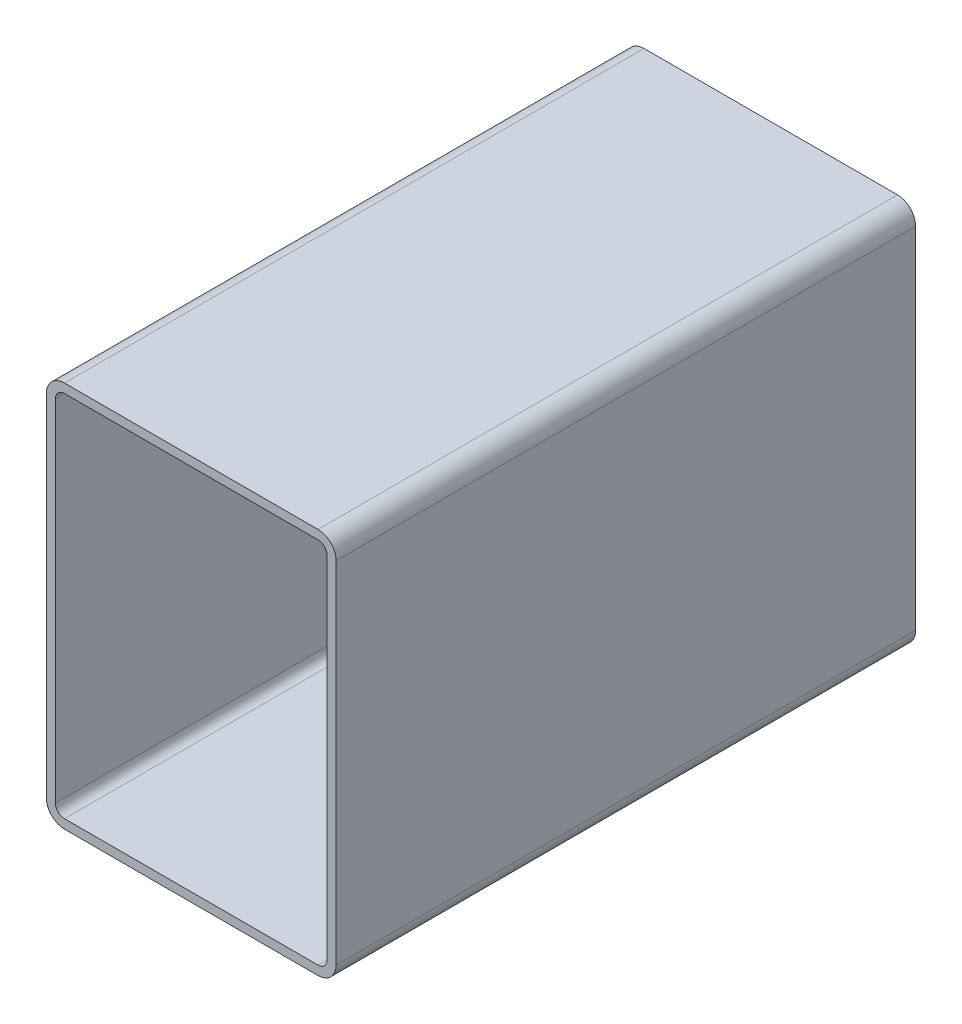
ISO-10303-21;
HEADER;
FILE_DESCRIPTION(('STEP AP214'),'2;1');
FILE_NAME('part.step','',(''),(''),'','','');
FILE_SCHEMA(('AUTOMOTIVE_DESIGN { 1 0 10303 214 1 1 1 1 }'));
ENDSEC;
DATA;
#1=APPLICATION_CONTEXT('core data for automotive mechanical design processes');
#2=APPLICATION_PROTOCOL_DEFINITION('international standard','automotive_design',2000,#1);
#3=PRODUCT_CONTEXT('',#1,'mechanical');
#4=PRODUCT('Part','Part','',(#3));
#5=PRODUCT_RELATED_PRODUCT_CATEGORY('part','',(#4));
#6=PRODUCT_DEFINITION_FORMATION('','',#4);
#7=PRODUCT_DEFINITION_CONTEXT('part definition',#1,'design');
#8=PRODUCT_DEFINITION('design','',#6,#7);
#9=PRODUCT_DEFINITION_SHAPE('','',#8);
#10=(LENGTH_UNIT() NAMED_UNIT(*) SI_UNIT(.MILLI.,.METRE.));
#11=(NAMED_UNIT(*) PLANE_ANGLE_UNIT() SI_UNIT($,.RADIAN.));
#12=(NAMED_UNIT(*) SI_UNIT($,.STERADIAN.) SOLID_ANGLE_UNIT());
#13=UNCERTAINTY_MEASURE_WITH_UNIT(LENGTH_MEASURE(1.E-05),#10,'distance_accuracy_value','');
#14=(GEOMETRIC_REPRESENTATION_CONTEXT(3) GLOBAL_UNCERTAINTY_ASSIGNED_CONTEXT((#13)) GLOBAL_UNIT_ASSIGNED_CONTEXT((#10,
#11,#12)) REPRESENTATION_CONTEXT('',''));
#15=CARTESIAN_POINT('',(0.,0.,0.));
#16=DIRECTION('',(0.,0.,1.));
#17=DIRECTION('',(1.,0.,0.));
#18=AXIS2_PLACEMENT_3D('',#15,#16,#17);
#19=CARTESIAN_POINT('',(9.57230139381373,195.641130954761,304.8));
#20=DIRECTION('',(0.,0.,1.));
#21=DIRECTION('',(1.,0.,0.));
#22=AXIS2_PLACEMENT_3D('',#19,#20,#21);
#23=PLANE('',#22);
#24=CARTESIAN_POINT('',(9.57230139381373,195.641130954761,304.8));
#25=DIRECTION('',(0.,0.,1.));
#26=DIRECTION('',(1.,0.,0.));
#27=AXIS2_PLACEMENT_3D('',#24,#25,#26);
#28=CIRCLE('',#27,9.52500000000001);
#29=CARTESIAN_POINT('',(9.57230139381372,205.166130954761,304.8));
#30=VERTEX_POINT('',#29);
#31=CARTESIAN_POINT('',(0.0473013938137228,195.641130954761,304.8));
#32=VERTEX_POINT('',#31);
#33=EDGE_CURVE('E211',#30,#32,#28,.T.);
#34=ORIENTED_EDGE('',*,*,#33,.T.);
#35=DIRECTION('',(0.,-1.,0.));
#36=VECTOR('',#35,1.);
#37=CARTESIAN_POINT('',(0.0473013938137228,11.4911309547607,304.8));
#38=LINE('',#37,#36);
#39=CARTESIAN_POINT('',(0.0473013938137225,11.4911309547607,304.8));
#40=VERTEX_POINT('',#39);
#41=EDGE_CURVE('E214',#32,#40,#38,.T.);
#42=ORIENTED_EDGE('',*,*,#41,.T.);
#43=CARTESIAN_POINT('',(9.57230139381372,11.4911309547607,304.8));
#44=DIRECTION('',(0.,0.,1.));
#45=DIRECTION('',(1.,0.,0.));
#46=AXIS2_PLACEMENT_3D('',#43,#44,#45);
#47=CIRCLE('',#46,9.525);
#48=CARTESIAN_POINT('',(9.57230139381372,1.96613095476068,304.8));
#49=VERTEX_POINT('',#48);
#50=EDGE_CURVE('E217',#40,#49,#47,.T.);
#51=ORIENTED_EDGE('',*,*,#50,.T.);
#52=DIRECTION('',(1.,0.,0.));
#53=VECTOR('',#52,1.);
#54=CARTESIAN_POINT('',(142.922301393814,1.96613095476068,304.8));
#55=LINE('',#54,#53);
#56=CARTESIAN_POINT('',(142.922301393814,1.96613095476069,304.8));
#57=VERTEX_POINT('',#56);
#58=EDGE_CURVE('E219',#49,#57,#55,.T.);
#59=ORIENTED_EDGE('',*,*,#58,.T.);
#60=CARTESIAN_POINT('',(142.922301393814,11.4911309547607,304.8));
#61=DIRECTION('',(0.,0.,1.));
#62=DIRECTION('',(1.,0.,0.));
#63=AXIS2_PLACEMENT_3D('',#60,#61,#62);
#64=CIRCLE('',#63,9.52500000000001);
#65=CARTESIAN_POINT('',(152.447301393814,11.4911309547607,304.8));
#66=VERTEX_POINT('',#65);
#67=EDGE_CURVE('E221',#57,#66,#64,.T.);
#68=ORIENTED_EDGE('',*,*,#67,.T.);
#69=DIRECTION('',(0.,1.,0.));
#70=VECTOR('',#69,1.);
#71=CARTESIAN_POINT('',(152.447301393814,195.641130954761,304.8));
#72=LINE('',#71,#70);
#73=CARTESIAN_POINT('',(152.447301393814,195.641130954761,304.8));
#74=VERTEX_POINT('',#73);
#75=EDGE_CURVE('E223',#66,#74,#72,.T.);
#76=ORIENTED_EDGE('',*,*,#75,.T.);
#77=CARTESIAN_POINT('',(142.922301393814,195.641130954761,304.8));
#78=DIRECTION('',(0.,0.,1.));
#79=DIRECTION('',(1.,0.,0.));
#80=AXIS2_PLACEMENT_3D('',#77,#78,#79);
#81=CIRCLE('',#80,9.52500000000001);
#82=CARTESIAN_POINT('',(142.922301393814,205.166130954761,304.8));
#83=VERTEX_POINT('',#82);
#84=EDGE_CURVE('E225',#74,#83,#81,.T.);
#85=ORIENTED_EDGE('',*,*,#84,.T.);
#86=DIRECTION('',(-1.,0.,0.));
#87=VECTOR('',#86,1.);
#88=CARTESIAN_POINT('',(9.57230139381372,205.166130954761,304.8));
#89=LINE('',#88,#87);
#90=EDGE_CURVE('E227',#83,#30,#89,.T.);
#91=ORIENTED_EDGE('',*,*,#90,.T.);
#92=EDGE_LOOP('',(#34,#42,#51,#59,#68,#76,#85,#91));
#93=FACE_BOUND('',#92,.T.);
#94=DIRECTION('',(0.,-1.,0.));
#95=VECTOR('',#94,1.);
#96=CARTESIAN_POINT('',(4.80980139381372,11.4911309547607,304.8));
#97=LINE('',#96,#95);
#98=CARTESIAN_POINT('',(4.80980139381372,195.641130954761,304.8));
#99=VERTEX_POINT('',#98);
#100=CARTESIAN_POINT('',(4.80980139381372,11.4911309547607,304.8));
#101=VERTEX_POINT('',#100);
#102=EDGE_CURVE('E154',#99,#101,#97,.T.);
#103=ORIENTED_EDGE('',*,*,#102,.F.);
#104=CARTESIAN_POINT('',(9.57230139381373,195.641130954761,304.8));
#105=DIRECTION('',(0.,0.,1.));
#106=DIRECTION('',(1.,0.,0.));
#107=AXIS2_PLACEMENT_3D('',#104,#105,#106);
#108=CIRCLE('',#107,4.7625);
#109=CARTESIAN_POINT('',(9.57230139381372,200.403630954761,304.8));
#110=VERTEX_POINT('',#109);
#111=EDGE_CURVE('E146',#110,#99,#108,.T.);
#112=ORIENTED_EDGE('',*,*,#111,.F.);
#113=DIRECTION('',(-1.,0.,0.));
#114=VECTOR('',#113,1.);
#115=CARTESIAN_POINT('',(9.57230139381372,200.403630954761,304.8));
#116=LINE('',#115,#114);
#117=CARTESIAN_POINT('',(142.922301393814,200.403630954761,304.8));
#118=VERTEX_POINT('',#117);
#119=EDGE_CURVE('E179',#118,#110,#116,.T.);
#120=ORIENTED_EDGE('',*,*,#119,.F.);
#121=CARTESIAN_POINT('',(142.922301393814,195.641130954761,304.8));
#122=DIRECTION('',(0.,0.,1.));
#123=DIRECTION('',(1.,0.,0.));
#124=AXIS2_PLACEMENT_3D('',#121,#122,#123);
#125=CIRCLE('',#124,4.7625);
#126=CARTESIAN_POINT('',(147.684801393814,195.641130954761,304.8));
#127=VERTEX_POINT('',#126);
#128=EDGE_CURVE('E177',#127,#118,#125,.T.);
#129=ORIENTED_EDGE('',*,*,#128,.F.);
#130=DIRECTION('',(0.,1.,0.));
#131=VECTOR('',#130,1.);
#132=CARTESIAN_POINT('',(147.684801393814,195.641130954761,304.8));
#133=LINE('',#132,#131);
#134=CARTESIAN_POINT('',(147.684801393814,11.4911309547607,304.8));
#135=VERTEX_POINT('',#134);
#136=EDGE_CURVE('E175',#135,#127,#133,.T.);
#137=ORIENTED_EDGE('',*,*,#136,.F.);
#138=CARTESIAN_POINT('',(142.922301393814,11.4911309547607,304.8));
#139=DIRECTION('',(0.,0.,1.));
#140=DIRECTION('',(1.,0.,0.));
#141=AXIS2_PLACEMENT_3D('',#138,#139,#140);
#142=CIRCLE('',#141,4.7625);
#143=CARTESIAN_POINT('',(142.922301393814,6.72863095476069,304.8));
#144=VERTEX_POINT('',#143);
#145=EDGE_CURVE('E173',#144,#135,#142,.T.);
#146=ORIENTED_EDGE('',*,*,#145,.F.);
#147=DIRECTION('',(1.,0.,0.));
#148=VECTOR('',#147,1.);
#149=CARTESIAN_POINT('',(142.922301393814,6.72863095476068,304.8));
#150=LINE('',#149,#148);
#151=CARTESIAN_POINT('',(9.57230139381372,6.72863095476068,304.8));
#152=VERTEX_POINT('',#151);
#153=EDGE_CURVE('E169',#152,#144,#150,.T.);
#154=ORIENTED_EDGE('',*,*,#153,.F.);
#155=CARTESIAN_POINT('',(9.57230139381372,11.4911309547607,304.8));
#156=DIRECTION('',(0.,0.,1.));
#157=DIRECTION('',(1.,0.,0.));
#158=AXIS2_PLACEMENT_3D('',#155,#156,#157);
#159=CIRCLE('',#158,4.7625);
#160=EDGE_CURVE('E167',#101,#152,#159,.T.);
#161=ORIENTED_EDGE('',*,*,#160,.F.);
#162=EDGE_LOOP('',(#103,#112,#120,#129,#137,#146,#154,#161));
#163=FACE_BOUND('',#162,.T.);
#164=ADVANCED_FACE('F33',(#93,#163),#23,.T.);
#165=CARTESIAN_POINT('',(9.57230139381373,195.641130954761,0.));
#166=DIRECTION('',(0.,0.,1.));
#167=DIRECTION('',(1.,0.,0.));
#168=AXIS2_PLACEMENT_3D('',#165,#166,#167);
#169=PLANE('',#168);
#170=CARTESIAN_POINT('',(9.57230139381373,195.641130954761,0.));
#171=DIRECTION('',(0.,0.,1.));
#172=DIRECTION('',(1.,0.,0.));
#173=AXIS2_PLACEMENT_3D('',#170,#171,#172);
#174=CIRCLE('',#173,9.52500000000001);
#175=CARTESIAN_POINT('',(9.57230139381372,205.166130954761,0.));
#176=VERTEX_POINT('',#175);
#177=CARTESIAN_POINT('',(0.0473013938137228,195.641130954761,0.));
#178=VERTEX_POINT('',#177);
#179=EDGE_CURVE('E162',#176,#178,#174,.T.);
#180=ORIENTED_EDGE('',*,*,#179,.F.);
#181=DIRECTION('',(-1.,0.,0.));
#182=VECTOR('',#181,1.);
#183=CARTESIAN_POINT('',(9.57230139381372,205.166130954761,0.));
#184=LINE('',#183,#182);
#185=CARTESIAN_POINT('',(142.922301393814,205.166130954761,0.));
#186=VERTEX_POINT('',#185);
#187=EDGE_CURVE('E215',#186,#176,#184,.T.);
#188=ORIENTED_EDGE('',*,*,#187,.F.);
#189=CARTESIAN_POINT('',(142.922301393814,195.641130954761,0.));
#190=DIRECTION('',(0.,0.,1.));
#191=DIRECTION('',(1.,0.,0.));
#192=AXIS2_PLACEMENT_3D('',#189,#190,#191);
#193=CIRCLE('',#192,9.52500000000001);
#194=CARTESIAN_POINT('',(152.447301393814,195.641130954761,0.));
#195=VERTEX_POINT('',#194);
#196=EDGE_CURVE('E242',#195,#186,#193,.T.);
#197=ORIENTED_EDGE('',*,*,#196,.F.);
#198=DIRECTION('',(0.,1.,0.));
#199=VECTOR('',#198,1.);
#200=CARTESIAN_POINT('',(152.447301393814,195.641130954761,0.));
#201=LINE('',#200,#199);
#202=CARTESIAN_POINT('',(152.447301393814,11.4911309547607,0.));
#203=VERTEX_POINT('',#202);
#204=EDGE_CURVE('E240',#203,#195,#201,.T.);
#205=ORIENTED_EDGE('',*,*,#204,.F.);
#206=CARTESIAN_POINT('',(142.922301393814,11.4911309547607,0.));
#207=DIRECTION('',(0.,0.,1.));
#208=DIRECTION('',(1.,0.,0.));
#209=AXIS2_PLACEMENT_3D('',#206,#207,#208);
#210=CIRCLE('',#209,9.52500000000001);
#211=CARTESIAN_POINT('',(142.922301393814,1.96613095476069,0.));
#212=VERTEX_POINT('',#211);
#213=EDGE_CURVE('E238',#212,#203,#210,.T.);
#214=ORIENTED_EDGE('',*,*,#213,.F.);
#215=DIRECTION('',(1.,0.,0.));
#216=VECTOR('',#215,1.);
#217=CARTESIAN_POINT('',(142.922301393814,1.96613095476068,0.));
#218=LINE('',#217,#216);
#219=CARTESIAN_POINT('',(9.57230139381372,1.96613095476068,0.));
#220=VERTEX_POINT('',#219);
#221=EDGE_CURVE('E236',#220,#212,#218,.T.);
#222=ORIENTED_EDGE('',*,*,#221,.F.);
#223=CARTESIAN_POINT('',(9.57230139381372,11.4911309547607,0.));
#224=DIRECTION('',(0.,0.,1.));
#225=DIRECTION('',(1.,0.,0.));
#226=AXIS2_PLACEMENT_3D('',#223,#224,#225);
#227=CIRCLE('',#226,9.525);
#228=CARTESIAN_POINT('',(0.0473013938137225,11.4911309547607,0.));
#229=VERTEX_POINT('',#228);
#230=EDGE_CURVE('E234',#229,#220,#227,.T.);
#231=ORIENTED_EDGE('',*,*,#230,.F.);
#232=DIRECTION('',(0.,-1.,0.));
#233=VECTOR('',#232,1.);
#234=CARTESIAN_POINT('',(0.0473013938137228,11.4911309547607,0.));
#235=LINE('',#234,#233);
#236=EDGE_CURVE('E232',#178,#229,#235,.T.);
#237=ORIENTED_EDGE('',*,*,#236,.F.);
#238=EDGE_LOOP('',(#180,#188,#197,#205,#214,#222,#231,#237));
#239=FACE_BOUND('',#238,.T.);
#240=CARTESIAN_POINT('',(9.57230139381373,195.641130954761,0.));
#241=DIRECTION('',(0.,0.,1.));
#242=DIRECTION('',(1.,0.,0.));
#243=AXIS2_PLACEMENT_3D('',#240,#241,#242);
#244=CIRCLE('',#243,4.7625);
#245=CARTESIAN_POINT('',(9.57230139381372,200.403630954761,0.));
#246=VERTEX_POINT('',#245);
#247=CARTESIAN_POINT('',(4.80980139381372,195.641130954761,0.));
#248=VERTEX_POINT('',#247);
#249=EDGE_CURVE('E56',#246,#248,#244,.T.);
#250=ORIENTED_EDGE('',*,*,#249,.T.);
#251=DIRECTION('',(0.,-1.,0.));
#252=VECTOR('',#251,1.);
#253=CARTESIAN_POINT('',(4.80980139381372,11.4911309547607,0.));
#254=LINE('',#253,#252);
#255=CARTESIAN_POINT('',(4.80980139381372,11.4911309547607,0.));
#256=VERTEX_POINT('',#255);
#257=EDGE_CURVE('E161',#248,#256,#254,.T.);
#258=ORIENTED_EDGE('',*,*,#257,.T.);
#259=CARTESIAN_POINT('',(9.57230139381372,11.4911309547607,0.));
#260=DIRECTION('',(0.,0.,1.));
#261=DIRECTION('',(1.,0.,0.));
#262=AXIS2_PLACEMENT_3D('',#259,#260,#261);
#263=CIRCLE('',#262,4.7625);
#264=CARTESIAN_POINT('',(9.57230139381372,6.72863095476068,0.));
#265=VERTEX_POINT('',#264);
#266=EDGE_CURVE('E183',#256,#265,#263,.T.);
#267=ORIENTED_EDGE('',*,*,#266,.T.);
#268=DIRECTION('',(1.,0.,0.));
#269=VECTOR('',#268,1.);
#270=CARTESIAN_POINT('',(142.922301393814,6.72863095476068,0.));
#271=LINE('',#270,#269);
#272=CARTESIAN_POINT('',(142.922301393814,6.72863095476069,0.));
#273=VERTEX_POINT('',#272);
#274=EDGE_CURVE('E186',#265,#273,#271,.T.);
#275=ORIENTED_EDGE('',*,*,#274,.T.);
#276=CARTESIAN_POINT('',(142.922301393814,11.4911309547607,0.));
#277=DIRECTION('',(0.,0.,1.));
#278=DIRECTION('',(1.,0.,0.));
#279=AXIS2_PLACEMENT_3D('',#276,#277,#278);
#280=CIRCLE('',#279,4.7625);
#281=CARTESIAN_POINT('',(147.684801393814,11.4911309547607,0.));
#282=VERTEX_POINT('',#281);
#283=EDGE_CURVE('E189',#273,#282,#280,.T.);
#284=ORIENTED_EDGE('',*,*,#283,.T.);
#285=DIRECTION('',(0.,1.,0.));
#286=VECTOR('',#285,1.);
#287=CARTESIAN_POINT('',(147.684801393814,195.641130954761,0.));
#288=LINE('',#287,#286);
#289=CARTESIAN_POINT('',(147.684801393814,195.641130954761,0.));
#290=VERTEX_POINT('',#289);
#291=EDGE_CURVE('E192',#282,#290,#288,.T.);
#292=ORIENTED_EDGE('',*,*,#291,.T.);
#293=CARTESIAN_POINT('',(142.922301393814,195.641130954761,0.));
#294=DIRECTION('',(0.,0.,1.));
#295=DIRECTION('',(1.,0.,0.));
#296=AXIS2_PLACEMENT_3D('',#293,#294,#295);
#297=CIRCLE('',#296,4.7625);
#298=CARTESIAN_POINT('',(142.922301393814,200.403630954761,0.));
#299=VERTEX_POINT('',#298);
#300=EDGE_CURVE('E195',#290,#299,#297,.T.);
#301=ORIENTED_EDGE('',*,*,#300,.T.);
#302=DIRECTION('',(-1.,0.,0.));
#303=VECTOR('',#302,1.);
#304=CARTESIAN_POINT('',(9.57230139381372,200.403630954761,0.));
#305=LINE('',#304,#303);
#306=EDGE_CURVE('E155',#299,#246,#305,.T.);
#307=ORIENTED_EDGE('',*,*,#306,.T.);
#308=EDGE_LOOP('',(#250,#258,#267,#275,#284,#292,#301,#307));
#309=FACE_BOUND('',#308,.T.);
#310=ADVANCED_FACE('F272',(#239,#309),#169,.F.);
#311=CARTESIAN_POINT('',(9.57230139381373,195.641130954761,304.8));
#312=DIRECTION('',(0.,0.,-1.));
#313=DIRECTION('',(-1.,0.,0.));
#314=AXIS2_PLACEMENT_3D('',#311,#312,#313);
#315=CYLINDRICAL_SURFACE('',#314,9.52500000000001);
#316=ORIENTED_EDGE('',*,*,#179,.T.);
#317=DIRECTION('',(0.,0.,-1.));
#318=VECTOR('',#317,1.);
#319=CARTESIAN_POINT('',(0.0473013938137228,195.641130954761,304.8));
#320=LINE('',#319,#318);
#321=EDGE_CURVE('E11',#32,#178,#320,.T.);
#322=ORIENTED_EDGE('',*,*,#321,.F.);
#323=ORIENTED_EDGE('',*,*,#33,.F.);
#324=DIRECTION('',(0.,0.,-1.));
#325=VECTOR('',#324,1.);
#326=CARTESIAN_POINT('',(9.57230139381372,205.166130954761,304.8));
#327=LINE('',#326,#325);
#328=EDGE_CURVE('E229',#30,#176,#327,.T.);
#329=ORIENTED_EDGE('',*,*,#328,.T.);
#330=EDGE_LOOP('',(#316,#322,#323,#329));
#331=FACE_BOUND('',#330,.T.);
#332=ADVANCED_FACE('F35',(#331),#315,.T.);
#333=CARTESIAN_POINT('',(0.0473013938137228,11.4911309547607,304.8));
#334=DIRECTION('',(1.,0.,0.));
#335=DIRECTION('',(0.,0.,-1.));
#336=AXIS2_PLACEMENT_3D('',#333,#334,#335);
#337=PLANE('',#336);
#338=ORIENTED_EDGE('',*,*,#236,.T.);
#339=DIRECTION('',(0.,0.,-1.));
#340=VECTOR('',#339,1.);
#341=CARTESIAN_POINT('',(0.0473013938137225,11.4911309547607,304.8));
#342=LINE('',#341,#340);
#343=EDGE_CURVE('E41',#40,#229,#342,.T.);
#344=ORIENTED_EDGE('',*,*,#343,.F.);
#345=ORIENTED_EDGE('',*,*,#41,.F.);
#346=ORIENTED_EDGE('',*,*,#321,.T.);
#347=EDGE_LOOP('',(#338,#344,#345,#346));
#348=FACE_BOUND('',#347,.T.);
#349=ADVANCED_FACE('F289',(#348),#337,.F.);
#350=CARTESIAN_POINT('',(9.57230139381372,11.4911309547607,304.8));
#351=DIRECTION('',(0.,0.,-1.));
#352=DIRECTION('',(-1.,0.,0.));
#353=AXIS2_PLACEMENT_3D('',#350,#351,#352);
#354=CYLINDRICAL_SURFACE('',#353,9.525);
#355=ORIENTED_EDGE('',*,*,#230,.T.);
#356=DIRECTION('',(0.,0.,-1.));
#357=VECTOR('',#356,1.);
#358=CARTESIAN_POINT('',(9.57230139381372,1.96613095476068,304.8));
#359=LINE('',#358,#357);
#360=EDGE_CURVE('E259',#49,#220,#359,.T.);
#361=ORIENTED_EDGE('',*,*,#360,.F.);
#362=ORIENTED_EDGE('',*,*,#50,.F.);
#363=ORIENTED_EDGE('',*,*,#343,.T.);
#364=EDGE_LOOP('',(#355,#361,#362,#363));
#365=FACE_BOUND('',#364,.T.);
#366=ADVANCED_FACE('F266',(#365),#354,.T.);
#367=CARTESIAN_POINT('',(142.922301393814,1.96613095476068,304.8));
#368=DIRECTION('',(0.,1.,0.));
#369=DIRECTION('',(0.,0.,1.));
#370=AXIS2_PLACEMENT_3D('',#367,#368,#369);
#371=PLANE('',#370);
#372=ORIENTED_EDGE('',*,*,#221,.T.);
#373=DIRECTION('',(0.,0.,-1.));
#374=VECTOR('',#373,1.);
#375=CARTESIAN_POINT('',(142.922301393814,1.96613095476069,304.8));
#376=LINE('',#375,#374);
#377=EDGE_CURVE('E256',#57,#212,#376,.T.);
#378=ORIENTED_EDGE('',*,*,#377,.F.);
#379=ORIENTED_EDGE('',*,*,#58,.F.);
#380=ORIENTED_EDGE('',*,*,#360,.T.);
#381=EDGE_LOOP('',(#372,#378,#379,#380));
#382=FACE_BOUND('',#381,.T.);
#383=ADVANCED_FACE('F278',(#382),#371,.F.);
#384=CARTESIAN_POINT('',(142.922301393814,11.4911309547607,304.8));
#385=DIRECTION('',(0.,0.,-1.));
#386=DIRECTION('',(-1.,0.,0.));
#387=AXIS2_PLACEMENT_3D('',#384,#385,#386);
#388=CYLINDRICAL_SURFACE('',#387,9.52500000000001);
#389=ORIENTED_EDGE('',*,*,#213,.T.);
#390=DIRECTION('',(0.,0.,-1.));
#391=VECTOR('',#390,1.);
#392=CARTESIAN_POINT('',(152.447301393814,11.4911309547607,304.8));
#393=LINE('',#392,#391);
#394=EDGE_CURVE('E253',#66,#203,#393,.T.);
#395=ORIENTED_EDGE('',*,*,#394,.F.);
#396=ORIENTED_EDGE('',*,*,#67,.F.);
#397=ORIENTED_EDGE('',*,*,#377,.T.);
#398=EDGE_LOOP('',(#389,#395,#396,#397));
#399=FACE_BOUND('',#398,.T.);
#400=ADVANCED_FACE('F282',(#399),#388,.T.);
#401=CARTESIAN_POINT('',(152.447301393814,195.641130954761,304.8));
#402=DIRECTION('',(-1.,0.,0.));
#403=DIRECTION('',(0.,0.,1.));
#404=AXIS2_PLACEMENT_3D('',#401,#402,#403);
#405=PLANE('',#404);
#406=ORIENTED_EDGE('',*,*,#204,.T.);
#407=DIRECTION('',(0.,0.,-1.));
#408=VECTOR('',#407,1.);
#409=CARTESIAN_POINT('',(152.447301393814,195.641130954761,304.8));
#410=LINE('',#409,#408);
#411=EDGE_CURVE('E250',#74,#195,#410,.T.);
#412=ORIENTED_EDGE('',*,*,#411,.F.);
#413=ORIENTED_EDGE('',*,*,#75,.F.);
#414=ORIENTED_EDGE('',*,*,#394,.T.);
#415=EDGE_LOOP('',(#406,#412,#413,#414));
#416=FACE_BOUND('',#415,.T.);
#417=ADVANCED_FACE('F302',(#416),#405,.F.);
#418=CARTESIAN_POINT('',(142.922301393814,195.641130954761,304.8));
#419=DIRECTION('',(0.,0.,-1.));
#420=DIRECTION('',(-1.,0.,0.));
#421=AXIS2_PLACEMENT_3D('',#418,#419,#420);
#422=CYLINDRICAL_SURFACE('',#421,9.52500000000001);
#423=ORIENTED_EDGE('',*,*,#196,.T.);
#424=DIRECTION('',(0.,0.,-1.));
#425=VECTOR('',#424,1.);
#426=CARTESIAN_POINT('',(142.922301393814,205.166130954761,304.8));
#427=LINE('',#426,#425);
#428=EDGE_CURVE('E247',#83,#186,#427,.T.);
#429=ORIENTED_EDGE('',*,*,#428,.F.);
#430=ORIENTED_EDGE('',*,*,#84,.F.);
#431=ORIENTED_EDGE('',*,*,#411,.T.);
#432=EDGE_LOOP('',(#423,#429,#430,#431));
#433=FACE_BOUND('',#432,.T.);
#434=ADVANCED_FACE('F300',(#433),#422,.T.);
#435=CARTESIAN_POINT('',(9.57230139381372,205.166130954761,304.8));
#436=DIRECTION('',(0.,-1.,0.));
#437=DIRECTION('',(0.,0.,-1.));
#438=AXIS2_PLACEMENT_3D('',#435,#436,#437);
#439=PLANE('',#438);
#440=ORIENTED_EDGE('',*,*,#187,.T.);
#441=ORIENTED_EDGE('',*,*,#328,.F.);
#442=ORIENTED_EDGE('',*,*,#90,.F.);
#443=ORIENTED_EDGE('',*,*,#428,.T.);
#444=EDGE_LOOP('',(#440,#441,#442,#443));
#445=FACE_BOUND('',#444,.T.);
#446=ADVANCED_FACE('F295',(#445),#439,.F.);
#447=CARTESIAN_POINT('',(9.57230139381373,195.641130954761,304.8));
#448=DIRECTION('',(0.,0.,-1.));
#449=DIRECTION('',(-1.,0.,0.));
#450=AXIS2_PLACEMENT_3D('',#447,#448,#449);
#451=CYLINDRICAL_SURFACE('',#450,4.7625);
#452=ORIENTED_EDGE('',*,*,#249,.F.);
#453=DIRECTION('',(0.,0.,-1.));
#454=VECTOR('',#453,1.);
#455=CARTESIAN_POINT('',(9.57230139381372,200.403630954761,304.8));
#456=LINE('',#455,#454);
#457=EDGE_CURVE('E150',#110,#246,#456,.T.);
#458=ORIENTED_EDGE('',*,*,#457,.F.);
#459=ORIENTED_EDGE('',*,*,#111,.T.);
#460=DIRECTION('',(0.,0.,-1.));
#461=VECTOR('',#460,1.);
#462=CARTESIAN_POINT('',(4.80980139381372,195.641130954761,304.8));
#463=LINE('',#462,#461);
#464=EDGE_CURVE('E149',#99,#248,#463,.T.);
#465=ORIENTED_EDGE('',*,*,#464,.T.);
#466=EDGE_LOOP('',(#452,#458,#459,#465));
#467=FACE_BOUND('',#466,.T.);
#468=ADVANCED_FACE('F148',(#467),#451,.F.);
#469=CARTESIAN_POINT('',(4.80980139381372,11.4911309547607,304.8));
#470=DIRECTION('',(1.,0.,0.));
#471=DIRECTION('',(0.,0.,-1.));
#472=AXIS2_PLACEMENT_3D('',#469,#470,#471);
#473=PLANE('',#472);
#474=ORIENTED_EDGE('',*,*,#257,.F.);
#475=ORIENTED_EDGE('',*,*,#464,.F.);
#476=ORIENTED_EDGE('',*,*,#102,.T.);
#477=DIRECTION('',(0.,0.,-1.));
#478=VECTOR('',#477,1.);
#479=CARTESIAN_POINT('',(4.80980139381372,11.4911309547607,304.8));
#480=LINE('',#479,#478);
#481=EDGE_CURVE('E163',#101,#256,#480,.T.);
#482=ORIENTED_EDGE('',*,*,#481,.T.);
#483=EDGE_LOOP('',(#474,#475,#476,#482));
#484=FACE_BOUND('',#483,.T.);
#485=ADVANCED_FACE('F158',(#484),#473,.T.);
#486=CARTESIAN_POINT('',(9.57230139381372,11.4911309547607,304.8));
#487=DIRECTION('',(0.,0.,-1.));
#488=DIRECTION('',(-1.,0.,0.));
#489=AXIS2_PLACEMENT_3D('',#486,#487,#488);
#490=CYLINDRICAL_SURFACE('',#489,4.7625);
#491=ORIENTED_EDGE('',*,*,#266,.F.);
#492=ORIENTED_EDGE('',*,*,#481,.F.);
#493=ORIENTED_EDGE('',*,*,#160,.T.);
#494=DIRECTION('',(0.,0.,-1.));
#495=VECTOR('',#494,1.);
#496=CARTESIAN_POINT('',(9.57230139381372,6.72863095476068,304.8));
#497=LINE('',#496,#495);
#498=EDGE_CURVE('E208',#152,#265,#497,.T.);
#499=ORIENTED_EDGE('',*,*,#498,.T.);
#500=EDGE_LOOP('',(#491,#492,#493,#499));
#501=FACE_BOUND('',#500,.T.);
#502=ADVANCED_FACE('F327',(#501),#490,.F.);
#503=CARTESIAN_POINT('',(142.922301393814,6.72863095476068,304.8));
#504=DIRECTION('',(0.,1.,0.));
#505=DIRECTION('',(0.,0.,1.));
#506=AXIS2_PLACEMENT_3D('',#503,#504,#505);
#507=PLANE('',#506);
#508=ORIENTED_EDGE('',*,*,#274,.F.);
#509=ORIENTED_EDGE('',*,*,#498,.F.);
#510=ORIENTED_EDGE('',*,*,#153,.T.);
#511=DIRECTION('',(0.,0.,-1.));
#512=VECTOR('',#511,1.);
#513=CARTESIAN_POINT('',(142.922301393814,6.72863095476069,304.8));
#514=LINE('',#513,#512);
#515=EDGE_CURVE('E206',#144,#273,#514,.T.);
#516=ORIENTED_EDGE('',*,*,#515,.T.);
#517=EDGE_LOOP('',(#508,#509,#510,#516));
#518=FACE_BOUND('',#517,.T.);
#519=ADVANCED_FACE('F331',(#518),#507,.T.);
#520=CARTESIAN_POINT('',(142.922301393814,11.4911309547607,304.8));
#521=DIRECTION('',(0.,0.,-1.));
#522=DIRECTION('',(-1.,0.,0.));
#523=AXIS2_PLACEMENT_3D('',#520,#521,#522);
#524=CYLINDRICAL_SURFACE('',#523,4.7625);
#525=ORIENTED_EDGE('',*,*,#283,.F.);
#526=ORIENTED_EDGE('',*,*,#515,.F.);
#527=ORIENTED_EDGE('',*,*,#145,.T.);
#528=DIRECTION('',(0.,0.,-1.));
#529=VECTOR('',#528,1.);
#530=CARTESIAN_POINT('',(147.684801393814,11.4911309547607,304.8));
#531=LINE('',#530,#529);
#532=EDGE_CURVE('E204',#135,#282,#531,.T.);
#533=ORIENTED_EDGE('',*,*,#532,.T.);
#534=EDGE_LOOP('',(#525,#526,#527,#533));
#535=FACE_BOUND('',#534,.T.);
#536=ADVANCED_FACE('F337',(#535),#524,.F.);
#537=CARTESIAN_POINT('',(147.684801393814,195.641130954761,304.8));
#538=DIRECTION('',(-1.,0.,0.));
#539=DIRECTION('',(0.,0.,1.));
#540=AXIS2_PLACEMENT_3D('',#537,#538,#539);
#541=PLANE('',#540);
#542=ORIENTED_EDGE('',*,*,#291,.F.);
#543=ORIENTED_EDGE('',*,*,#532,.F.);
#544=ORIENTED_EDGE('',*,*,#136,.T.);
#545=DIRECTION('',(0.,0.,-1.));
#546=VECTOR('',#545,1.);
#547=CARTESIAN_POINT('',(147.684801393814,195.641130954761,304.8));
#548=LINE('',#547,#546);
#549=EDGE_CURVE('E202',#127,#290,#548,.T.);
#550=ORIENTED_EDGE('',*,*,#549,.T.);
#551=EDGE_LOOP('',(#542,#543,#544,#550));
#552=FACE_BOUND('',#551,.T.);
#553=ADVANCED_FACE('F341',(#552),#541,.T.);
#554=CARTESIAN_POINT('',(142.922301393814,195.641130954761,304.8));
#555=DIRECTION('',(0.,0.,-1.));
#556=DIRECTION('',(-1.,0.,0.));
#557=AXIS2_PLACEMENT_3D('',#554,#555,#556);
#558=CYLINDRICAL_SURFACE('',#557,4.7625);
#559=ORIENTED_EDGE('',*,*,#300,.F.);
#560=ORIENTED_EDGE('',*,*,#549,.F.);
#561=ORIENTED_EDGE('',*,*,#128,.T.);
#562=DIRECTION('',(0.,0.,-1.));
#563=VECTOR('',#562,1.);
#564=CARTESIAN_POINT('',(142.922301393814,200.403630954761,304.8));
#565=LINE('',#564,#563);
#566=EDGE_CURVE('E48',#118,#299,#565,.T.);
#567=ORIENTED_EDGE('',*,*,#566,.T.);
#568=EDGE_LOOP('',(#559,#560,#561,#567));
#569=FACE_BOUND('',#568,.T.);
#570=ADVANCED_FACE('F345',(#569),#558,.F.);
#571=CARTESIAN_POINT('',(9.57230139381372,200.403630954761,304.8));
#572=DIRECTION('',(0.,-1.,0.));
#573=DIRECTION('',(0.,0.,-1.));
#574=AXIS2_PLACEMENT_3D('',#571,#572,#573);
#575=PLANE('',#574);
#576=ORIENTED_EDGE('',*,*,#306,.F.);
#577=ORIENTED_EDGE('',*,*,#566,.F.);
#578=ORIENTED_EDGE('',*,*,#119,.T.);
#579=ORIENTED_EDGE('',*,*,#457,.T.);
#580=EDGE_LOOP('',(#576,#577,#578,#579));
#581=FACE_BOUND('',#580,.T.);
#582=ADVANCED_FACE('F349',(#581),#575,.T.);
#583=CLOSED_SHELL('',(#164,#310,#332,#349,#366,#383,#400,#417,#434,#446,#468,#485,#502,#519,
#536,#553,#570,#582));
#584=MANIFOLD_SOLID_BREP('B2',#583);
#585=ADVANCED_BREP_SHAPE_REPRESENTATION('',(#18,#584),#14);
#586=SHAPE_DEFINITION_REPRESENTATION(#9,#585);
ENDSEC;
END-ISO-10303-21;
